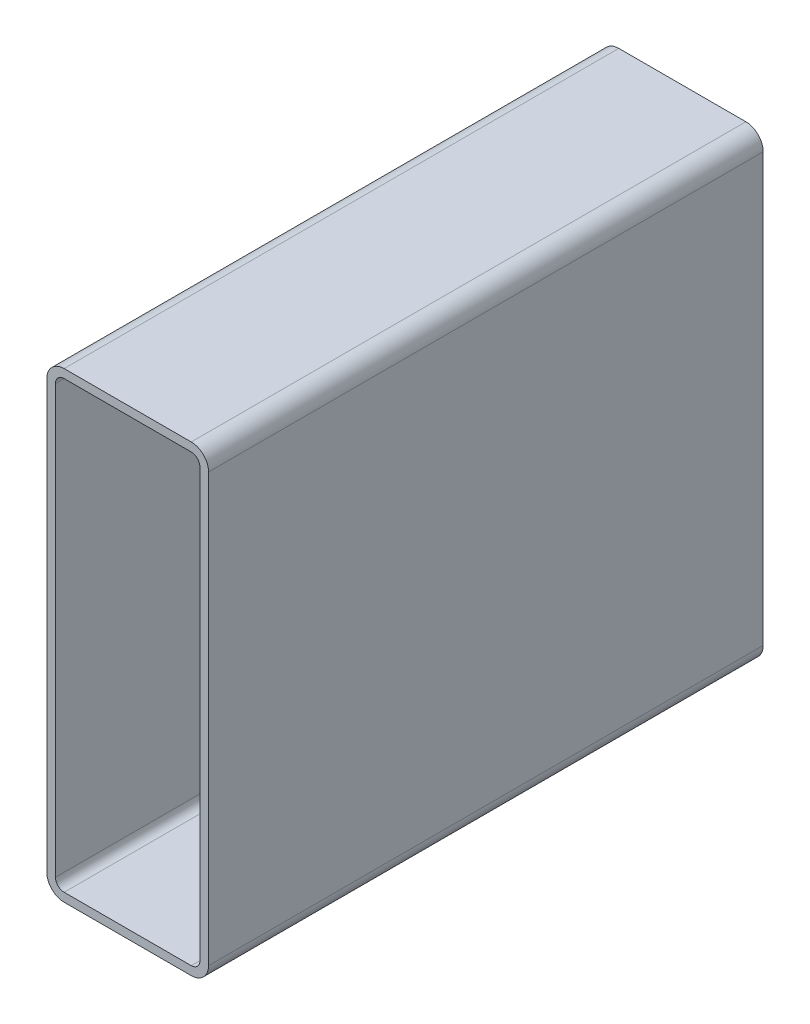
ISO-10303-21;
HEADER;
FILE_DESCRIPTION(('STEP AP214'),'2;1');
FILE_NAME('part.step','',(''),(''),'','','');
FILE_SCHEMA(('AUTOMOTIVE_DESIGN { 1 0 10303 214 1 1 1 1 }'));
ENDSEC;
DATA;
#1=APPLICATION_CONTEXT('core data for automotive mechanical design processes');
#2=APPLICATION_PROTOCOL_DEFINITION('international standard','automotive_design',2000,#1);
#3=PRODUCT_CONTEXT('',#1,'mechanical');
#4=PRODUCT('Part','Part','',(#3));
#5=PRODUCT_RELATED_PRODUCT_CATEGORY('part','',(#4));
#6=PRODUCT_DEFINITION_FORMATION('','',#4);
#7=PRODUCT_DEFINITION_CONTEXT('part definition',#1,'design');
#8=PRODUCT_DEFINITION('design','',#6,#7);
#9=PRODUCT_DEFINITION_SHAPE('','',#8);
#10=(LENGTH_UNIT() NAMED_UNIT(*) SI_UNIT(.MILLI.,.METRE.));
#11=(NAMED_UNIT(*) PLANE_ANGLE_UNIT() SI_UNIT($,.RADIAN.));
#12=(NAMED_UNIT(*) SI_UNIT($,.STERADIAN.) SOLID_ANGLE_UNIT());
#13=UNCERTAINTY_MEASURE_WITH_UNIT(LENGTH_MEASURE(1.E-05),#10,'distance_accuracy_value','');
#14=(GEOMETRIC_REPRESENTATION_CONTEXT(3) GLOBAL_UNCERTAINTY_ASSIGNED_CONTEXT((#13)) GLOBAL_UNIT_ASSIGNED_CONTEXT((#10,
#11,#12)) REPRESENTATION_CONTEXT('',''));
#15=CARTESIAN_POINT('',(0.,0.,0.));
#16=DIRECTION('',(0.,0.,1.));
#17=DIRECTION('',(1.,0.,0.));
#18=AXIS2_PLACEMENT_3D('',#15,#16,#17);
#19=CARTESIAN_POINT('',(11.6071469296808,246.395313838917,304.8));
#20=DIRECTION('',(0.,0.,1.));
#21=DIRECTION('',(1.,0.,0.));
#22=AXIS2_PLACEMENT_3D('',#19,#20,#21);
#23=PLANE('',#22);
#24=CARTESIAN_POINT('',(11.6071469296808,246.395313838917,304.8));
#25=DIRECTION('',(0.,0.,1.));
#26=DIRECTION('',(1.,0.,0.));
#27=AXIS2_PLACEMENT_3D('',#24,#25,#26);
#28=CIRCLE('',#27,9.52500000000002);
#29=CARTESIAN_POINT('',(11.6071469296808,255.920313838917,304.8));
#30=VERTEX_POINT('',#29);
#31=CARTESIAN_POINT('',(2.08214692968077,246.395313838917,304.8));
#32=VERTEX_POINT('',#31);
#33=EDGE_CURVE('E211',#30,#32,#28,.T.);
#34=ORIENTED_EDGE('',*,*,#33,.T.);
#35=DIRECTION('',(0.,-1.,0.));
#36=VECTOR('',#35,1.);
#37=CARTESIAN_POINT('',(2.08214692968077,11.4453138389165,304.8));
#38=LINE('',#37,#36);
#39=CARTESIAN_POINT('',(2.08214692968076,11.4453138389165,304.8));
#40=VERTEX_POINT('',#39);
#41=EDGE_CURVE('E214',#32,#40,#38,.T.);
#42=ORIENTED_EDGE('',*,*,#41,.T.);
#43=CARTESIAN_POINT('',(11.6071469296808,11.4453138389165,304.8));
#44=DIRECTION('',(0.,0.,1.));
#45=DIRECTION('',(1.,0.,0.));
#46=AXIS2_PLACEMENT_3D('',#43,#44,#45);
#47=CIRCLE('',#46,9.525);
#48=CARTESIAN_POINT('',(11.6071469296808,1.92031383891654,304.8));
#49=VERTEX_POINT('',#48);
#50=EDGE_CURVE('E217',#40,#49,#47,.T.);
#51=ORIENTED_EDGE('',*,*,#50,.T.);
#52=DIRECTION('',(1.,0.,0.));
#53=VECTOR('',#52,1.);
#54=CARTESIAN_POINT('',(81.4571469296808,1.92031383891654,304.8));
#55=LINE('',#54,#53);
#56=CARTESIAN_POINT('',(81.4571469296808,1.92031383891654,304.8));
#57=VERTEX_POINT('',#56);
#58=EDGE_CURVE('E219',#49,#57,#55,.T.);
#59=ORIENTED_EDGE('',*,*,#58,.T.);
#60=CARTESIAN_POINT('',(81.4571469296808,11.4453138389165,304.8));
#61=DIRECTION('',(0.,0.,1.));
#62=DIRECTION('',(1.,0.,0.));
#63=AXIS2_PLACEMENT_3D('',#60,#61,#62);
#64=CIRCLE('',#63,9.52500000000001);
#65=CARTESIAN_POINT('',(90.9821469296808,11.4453138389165,304.8));
#66=VERTEX_POINT('',#65);
#67=EDGE_CURVE('E221',#57,#66,#64,.T.);
#68=ORIENTED_EDGE('',*,*,#67,.T.);
#69=DIRECTION('',(0.,1.,0.));
#70=VECTOR('',#69,1.);
#71=CARTESIAN_POINT('',(90.9821469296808,246.395313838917,304.8));
#72=LINE('',#71,#70);
#73=CARTESIAN_POINT('',(90.9821469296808,246.395313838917,304.8));
#74=VERTEX_POINT('',#73);
#75=EDGE_CURVE('E223',#66,#74,#72,.T.);
#76=ORIENTED_EDGE('',*,*,#75,.T.);
#77=CARTESIAN_POINT('',(81.4571469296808,246.395313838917,304.8));
#78=DIRECTION('',(0.,0.,1.));
#79=DIRECTION('',(1.,0.,0.));
#80=AXIS2_PLACEMENT_3D('',#77,#78,#79);
#81=CIRCLE('',#80,9.52500000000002);
#82=CARTESIAN_POINT('',(81.4571469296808,255.920313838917,304.8));
#83=VERTEX_POINT('',#82);
#84=EDGE_CURVE('E225',#74,#83,#81,.T.);
#85=ORIENTED_EDGE('',*,*,#84,.T.);
#86=DIRECTION('',(-1.,0.,0.));
#87=VECTOR('',#86,1.);
#88=CARTESIAN_POINT('',(11.6071469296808,255.920313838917,304.8));
#89=LINE('',#88,#87);
#90=EDGE_CURVE('E227',#83,#30,#89,.T.);
#91=ORIENTED_EDGE('',*,*,#90,.T.);
#92=EDGE_LOOP('',(#34,#42,#51,#59,#68,#76,#85,#91));
#93=FACE_BOUND('',#92,.T.);
#94=DIRECTION('',(0.,-1.,0.));
#95=VECTOR('',#94,1.);
#96=CARTESIAN_POINT('',(6.84464692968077,11.4453138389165,304.8));
#97=LINE('',#96,#95);
#98=CARTESIAN_POINT('',(6.84464692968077,246.395313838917,304.8));
#99=VERTEX_POINT('',#98);
#100=CARTESIAN_POINT('',(6.84464692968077,11.4453138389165,304.8));
#101=VERTEX_POINT('',#100);
#102=EDGE_CURVE('E154',#99,#101,#97,.T.);
#103=ORIENTED_EDGE('',*,*,#102,.F.);
#104=CARTESIAN_POINT('',(11.6071469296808,246.395313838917,304.8));
#105=DIRECTION('',(0.,0.,1.));
#106=DIRECTION('',(1.,0.,0.));
#107=AXIS2_PLACEMENT_3D('',#104,#105,#106);
#108=CIRCLE('',#107,4.76250000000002);
#109=CARTESIAN_POINT('',(11.6071469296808,251.157813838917,304.8));
#110=VERTEX_POINT('',#109);
#111=EDGE_CURVE('E146',#110,#99,#108,.T.);
#112=ORIENTED_EDGE('',*,*,#111,.F.);
#113=DIRECTION('',(-1.,0.,0.));
#114=VECTOR('',#113,1.);
#115=CARTESIAN_POINT('',(11.6071469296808,251.157813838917,304.8));
#116=LINE('',#115,#114);
#117=CARTESIAN_POINT('',(81.4571469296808,251.157813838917,304.8));
#118=VERTEX_POINT('',#117);
#119=EDGE_CURVE('E179',#118,#110,#116,.T.);
#120=ORIENTED_EDGE('',*,*,#119,.F.);
#121=CARTESIAN_POINT('',(81.4571469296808,246.395313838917,304.8));
#122=DIRECTION('',(0.,0.,1.));
#123=DIRECTION('',(1.,0.,0.));
#124=AXIS2_PLACEMENT_3D('',#121,#122,#123);
#125=CIRCLE('',#124,4.76250000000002);
#126=CARTESIAN_POINT('',(86.2196469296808,246.395313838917,304.8));
#127=VERTEX_POINT('',#126);
#128=EDGE_CURVE('E177',#127,#118,#125,.T.);
#129=ORIENTED_EDGE('',*,*,#128,.F.);
#130=DIRECTION('',(0.,1.,0.));
#131=VECTOR('',#130,1.);
#132=CARTESIAN_POINT('',(86.2196469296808,246.395313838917,304.8));
#133=LINE('',#132,#131);
#134=CARTESIAN_POINT('',(86.2196469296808,11.4453138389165,304.8));
#135=VERTEX_POINT('',#134);
#136=EDGE_CURVE('E175',#135,#127,#133,.T.);
#137=ORIENTED_EDGE('',*,*,#136,.F.);
#138=CARTESIAN_POINT('',(81.4571469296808,11.4453138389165,304.8));
#139=DIRECTION('',(0.,0.,1.));
#140=DIRECTION('',(1.,0.,0.));
#141=AXIS2_PLACEMENT_3D('',#138,#139,#140);
#142=CIRCLE('',#141,4.7625);
#143=CARTESIAN_POINT('',(81.4571469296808,6.68281383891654,304.8));
#144=VERTEX_POINT('',#143);
#145=EDGE_CURVE('E173',#144,#135,#142,.T.);
#146=ORIENTED_EDGE('',*,*,#145,.F.);
#147=DIRECTION('',(1.,0.,0.));
#148=VECTOR('',#147,1.);
#149=CARTESIAN_POINT('',(81.4571469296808,6.68281383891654,304.8));
#150=LINE('',#149,#148);
#151=CARTESIAN_POINT('',(11.6071469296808,6.68281383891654,304.8));
#152=VERTEX_POINT('',#151);
#153=EDGE_CURVE('E169',#152,#144,#150,.T.);
#154=ORIENTED_EDGE('',*,*,#153,.F.);
#155=CARTESIAN_POINT('',(11.6071469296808,11.4453138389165,304.8));
#156=DIRECTION('',(0.,0.,1.));
#157=DIRECTION('',(1.,0.,0.));
#158=AXIS2_PLACEMENT_3D('',#155,#156,#157);
#159=CIRCLE('',#158,4.7625);
#160=EDGE_CURVE('E167',#101,#152,#159,.T.);
#161=ORIENTED_EDGE('',*,*,#160,.F.);
#162=EDGE_LOOP('',(#103,#112,#120,#129,#137,#146,#154,#161));
#163=FACE_BOUND('',#162,.T.);
#164=ADVANCED_FACE('F33',(#93,#163),#23,.T.);
#165=CARTESIAN_POINT('',(11.6071469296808,246.395313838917,0.));
#166=DIRECTION('',(0.,0.,1.));
#167=DIRECTION('',(1.,0.,0.));
#168=AXIS2_PLACEMENT_3D('',#165,#166,#167);
#169=PLANE('',#168);
#170=CARTESIAN_POINT('',(11.6071469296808,246.395313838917,0.));
#171=DIRECTION('',(0.,0.,1.));
#172=DIRECTION('',(1.,0.,0.));
#173=AXIS2_PLACEMENT_3D('',#170,#171,#172);
#174=CIRCLE('',#173,9.52500000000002);
#175=CARTESIAN_POINT('',(11.6071469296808,255.920313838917,0.));
#176=VERTEX_POINT('',#175);
#177=CARTESIAN_POINT('',(2.08214692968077,246.395313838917,0.));
#178=VERTEX_POINT('',#177);
#179=EDGE_CURVE('E162',#176,#178,#174,.T.);
#180=ORIENTED_EDGE('',*,*,#179,.F.);
#181=DIRECTION('',(-1.,0.,0.));
#182=VECTOR('',#181,1.);
#183=CARTESIAN_POINT('',(11.6071469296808,255.920313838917,0.));
#184=LINE('',#183,#182);
#185=CARTESIAN_POINT('',(81.4571469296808,255.920313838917,0.));
#186=VERTEX_POINT('',#185);
#187=EDGE_CURVE('E215',#186,#176,#184,.T.);
#188=ORIENTED_EDGE('',*,*,#187,.F.);
#189=CARTESIAN_POINT('',(81.4571469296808,246.395313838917,0.));
#190=DIRECTION('',(0.,0.,1.));
#191=DIRECTION('',(1.,0.,0.));
#192=AXIS2_PLACEMENT_3D('',#189,#190,#191);
#193=CIRCLE('',#192,9.52500000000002);
#194=CARTESIAN_POINT('',(90.9821469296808,246.395313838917,0.));
#195=VERTEX_POINT('',#194);
#196=EDGE_CURVE('E242',#195,#186,#193,.T.);
#197=ORIENTED_EDGE('',*,*,#196,.F.);
#198=DIRECTION('',(0.,1.,0.));
#199=VECTOR('',#198,1.);
#200=CARTESIAN_POINT('',(90.9821469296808,246.395313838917,0.));
#201=LINE('',#200,#199);
#202=CARTESIAN_POINT('',(90.9821469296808,11.4453138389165,0.));
#203=VERTEX_POINT('',#202);
#204=EDGE_CURVE('E240',#203,#195,#201,.T.);
#205=ORIENTED_EDGE('',*,*,#204,.F.);
#206=CARTESIAN_POINT('',(81.4571469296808,11.4453138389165,0.));
#207=DIRECTION('',(0.,0.,1.));
#208=DIRECTION('',(1.,0.,0.));
#209=AXIS2_PLACEMENT_3D('',#206,#207,#208);
#210=CIRCLE('',#209,9.52500000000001);
#211=CARTESIAN_POINT('',(81.4571469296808,1.92031383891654,0.));
#212=VERTEX_POINT('',#211);
#213=EDGE_CURVE('E238',#212,#203,#210,.T.);
#214=ORIENTED_EDGE('',*,*,#213,.F.);
#215=DIRECTION('',(1.,0.,0.));
#216=VECTOR('',#215,1.);
#217=CARTESIAN_POINT('',(81.4571469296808,1.92031383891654,0.));
#218=LINE('',#217,#216);
#219=CARTESIAN_POINT('',(11.6071469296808,1.92031383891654,0.));
#220=VERTEX_POINT('',#219);
#221=EDGE_CURVE('E236',#220,#212,#218,.T.);
#222=ORIENTED_EDGE('',*,*,#221,.F.);
#223=CARTESIAN_POINT('',(11.6071469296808,11.4453138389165,0.));
#224=DIRECTION('',(0.,0.,1.));
#225=DIRECTION('',(1.,0.,0.));
#226=AXIS2_PLACEMENT_3D('',#223,#224,#225);
#227=CIRCLE('',#226,9.525);
#228=CARTESIAN_POINT('',(2.08214692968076,11.4453138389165,0.));
#229=VERTEX_POINT('',#228);
#230=EDGE_CURVE('E234',#229,#220,#227,.T.);
#231=ORIENTED_EDGE('',*,*,#230,.F.);
#232=DIRECTION('',(0.,-1.,0.));
#233=VECTOR('',#232,1.);
#234=CARTESIAN_POINT('',(2.08214692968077,11.4453138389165,0.));
#235=LINE('',#234,#233);
#236=EDGE_CURVE('E232',#178,#229,#235,.T.);
#237=ORIENTED_EDGE('',*,*,#236,.F.);
#238=EDGE_LOOP('',(#180,#188,#197,#205,#214,#222,#231,#237));
#239=FACE_BOUND('',#238,.T.);
#240=CARTESIAN_POINT('',(11.6071469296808,246.395313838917,0.));
#241=DIRECTION('',(0.,0.,1.));
#242=DIRECTION('',(1.,0.,0.));
#243=AXIS2_PLACEMENT_3D('',#240,#241,#242);
#244=CIRCLE('',#243,4.76250000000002);
#245=CARTESIAN_POINT('',(11.6071469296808,251.157813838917,0.));
#246=VERTEX_POINT('',#245);
#247=CARTESIAN_POINT('',(6.84464692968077,246.395313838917,0.));
#248=VERTEX_POINT('',#247);
#249=EDGE_CURVE('E56',#246,#248,#244,.T.);
#250=ORIENTED_EDGE('',*,*,#249,.T.);
#251=DIRECTION('',(0.,-1.,0.));
#252=VECTOR('',#251,1.);
#253=CARTESIAN_POINT('',(6.84464692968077,11.4453138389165,0.));
#254=LINE('',#253,#252);
#255=CARTESIAN_POINT('',(6.84464692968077,11.4453138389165,0.));
#256=VERTEX_POINT('',#255);
#257=EDGE_CURVE('E161',#248,#256,#254,.T.);
#258=ORIENTED_EDGE('',*,*,#257,.T.);
#259=CARTESIAN_POINT('',(11.6071469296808,11.4453138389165,0.));
#260=DIRECTION('',(0.,0.,1.));
#261=DIRECTION('',(1.,0.,0.));
#262=AXIS2_PLACEMENT_3D('',#259,#260,#261);
#263=CIRCLE('',#262,4.7625);
#264=CARTESIAN_POINT('',(11.6071469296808,6.68281383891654,0.));
#265=VERTEX_POINT('',#264);
#266=EDGE_CURVE('E183',#256,#265,#263,.T.);
#267=ORIENTED_EDGE('',*,*,#266,.T.);
#268=DIRECTION('',(1.,0.,0.));
#269=VECTOR('',#268,1.);
#270=CARTESIAN_POINT('',(81.4571469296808,6.68281383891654,0.));
#271=LINE('',#270,#269);
#272=CARTESIAN_POINT('',(81.4571469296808,6.68281383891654,0.));
#273=VERTEX_POINT('',#272);
#274=EDGE_CURVE('E186',#265,#273,#271,.T.);
#275=ORIENTED_EDGE('',*,*,#274,.T.);
#276=CARTESIAN_POINT('',(81.4571469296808,11.4453138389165,0.));
#277=DIRECTION('',(0.,0.,1.));
#278=DIRECTION('',(1.,0.,0.));
#279=AXIS2_PLACEMENT_3D('',#276,#277,#278);
#280=CIRCLE('',#279,4.7625);
#281=CARTESIAN_POINT('',(86.2196469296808,11.4453138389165,0.));
#282=VERTEX_POINT('',#281);
#283=EDGE_CURVE('E189',#273,#282,#280,.T.);
#284=ORIENTED_EDGE('',*,*,#283,.T.);
#285=DIRECTION('',(0.,1.,0.));
#286=VECTOR('',#285,1.);
#287=CARTESIAN_POINT('',(86.2196469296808,246.395313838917,0.));
#288=LINE('',#287,#286);
#289=CARTESIAN_POINT('',(86.2196469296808,246.395313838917,0.));
#290=VERTEX_POINT('',#289);
#291=EDGE_CURVE('E192',#282,#290,#288,.T.);
#292=ORIENTED_EDGE('',*,*,#291,.T.);
#293=CARTESIAN_POINT('',(81.4571469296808,246.395313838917,0.));
#294=DIRECTION('',(0.,0.,1.));
#295=DIRECTION('',(1.,0.,0.));
#296=AXIS2_PLACEMENT_3D('',#293,#294,#295);
#297=CIRCLE('',#296,4.76250000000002);
#298=CARTESIAN_POINT('',(81.4571469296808,251.157813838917,0.));
#299=VERTEX_POINT('',#298);
#300=EDGE_CURVE('E195',#290,#299,#297,.T.);
#301=ORIENTED_EDGE('',*,*,#300,.T.);
#302=DIRECTION('',(-1.,0.,0.));
#303=VECTOR('',#302,1.);
#304=CARTESIAN_POINT('',(11.6071469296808,251.157813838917,0.));
#305=LINE('',#304,#303);
#306=EDGE_CURVE('E155',#299,#246,#305,.T.);
#307=ORIENTED_EDGE('',*,*,#306,.T.);
#308=EDGE_LOOP('',(#250,#258,#267,#275,#284,#292,#301,#307));
#309=FACE_BOUND('',#308,.T.);
#310=ADVANCED_FACE('F272',(#239,#309),#169,.F.);
#311=CARTESIAN_POINT('',(11.6071469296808,246.395313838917,304.8));
#312=DIRECTION('',(0.,0.,-1.));
#313=DIRECTION('',(-1.,0.,0.));
#314=AXIS2_PLACEMENT_3D('',#311,#312,#313);
#315=CYLINDRICAL_SURFACE('',#314,9.52500000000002);
#316=ORIENTED_EDGE('',*,*,#179,.T.);
#317=DIRECTION('',(0.,0.,-1.));
#318=VECTOR('',#317,1.);
#319=CARTESIAN_POINT('',(2.08214692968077,246.395313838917,304.8));
#320=LINE('',#319,#318);
#321=EDGE_CURVE('E11',#32,#178,#320,.T.);
#322=ORIENTED_EDGE('',*,*,#321,.F.);
#323=ORIENTED_EDGE('',*,*,#33,.F.);
#324=DIRECTION('',(0.,0.,-1.));
#325=VECTOR('',#324,1.);
#326=CARTESIAN_POINT('',(11.6071469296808,255.920313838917,304.8));
#327=LINE('',#326,#325);
#328=EDGE_CURVE('E229',#30,#176,#327,.T.);
#329=ORIENTED_EDGE('',*,*,#328,.T.);
#330=EDGE_LOOP('',(#316,#322,#323,#329));
#331=FACE_BOUND('',#330,.T.);
#332=ADVANCED_FACE('F35',(#331),#315,.T.);
#333=CARTESIAN_POINT('',(2.08214692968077,11.4453138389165,304.8));
#334=DIRECTION('',(1.,0.,0.));
#335=DIRECTION('',(0.,0.,-1.));
#336=AXIS2_PLACEMENT_3D('',#333,#334,#335);
#337=PLANE('',#336);
#338=ORIENTED_EDGE('',*,*,#236,.T.);
#339=DIRECTION('',(0.,0.,-1.));
#340=VECTOR('',#339,1.);
#341=CARTESIAN_POINT('',(2.08214692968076,11.4453138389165,304.8));
#342=LINE('',#341,#340);
#343=EDGE_CURVE('E41',#40,#229,#342,.T.);
#344=ORIENTED_EDGE('',*,*,#343,.F.);
#345=ORIENTED_EDGE('',*,*,#41,.F.);
#346=ORIENTED_EDGE('',*,*,#321,.T.);
#347=EDGE_LOOP('',(#338,#344,#345,#346));
#348=FACE_BOUND('',#347,.T.);
#349=ADVANCED_FACE('F289',(#348),#337,.F.);
#350=CARTESIAN_POINT('',(11.6071469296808,11.4453138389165,304.8));
#351=DIRECTION('',(0.,0.,-1.));
#352=DIRECTION('',(-1.,0.,0.));
#353=AXIS2_PLACEMENT_3D('',#350,#351,#352);
#354=CYLINDRICAL_SURFACE('',#353,9.525);
#355=ORIENTED_EDGE('',*,*,#230,.T.);
#356=DIRECTION('',(0.,0.,-1.));
#357=VECTOR('',#356,1.);
#358=CARTESIAN_POINT('',(11.6071469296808,1.92031383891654,304.8));
#359=LINE('',#358,#357);
#360=EDGE_CURVE('E259',#49,#220,#359,.T.);
#361=ORIENTED_EDGE('',*,*,#360,.F.);
#362=ORIENTED_EDGE('',*,*,#50,.F.);
#363=ORIENTED_EDGE('',*,*,#343,.T.);
#364=EDGE_LOOP('',(#355,#361,#362,#363));
#365=FACE_BOUND('',#364,.T.);
#366=ADVANCED_FACE('F266',(#365),#354,.T.);
#367=CARTESIAN_POINT('',(81.4571469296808,1.92031383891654,304.8));
#368=DIRECTION('',(0.,1.,0.));
#369=DIRECTION('',(0.,0.,1.));
#370=AXIS2_PLACEMENT_3D('',#367,#368,#369);
#371=PLANE('',#370);
#372=ORIENTED_EDGE('',*,*,#221,.T.);
#373=DIRECTION('',(0.,0.,-1.));
#374=VECTOR('',#373,1.);
#375=CARTESIAN_POINT('',(81.4571469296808,1.92031383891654,304.8));
#376=LINE('',#375,#374);
#377=EDGE_CURVE('E256',#57,#212,#376,.T.);
#378=ORIENTED_EDGE('',*,*,#377,.F.);
#379=ORIENTED_EDGE('',*,*,#58,.F.);
#380=ORIENTED_EDGE('',*,*,#360,.T.);
#381=EDGE_LOOP('',(#372,#378,#379,#380));
#382=FACE_BOUND('',#381,.T.);
#383=ADVANCED_FACE('F278',(#382),#371,.F.);
#384=CARTESIAN_POINT('',(81.4571469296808,11.4453138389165,304.8));
#385=DIRECTION('',(0.,0.,-1.));
#386=DIRECTION('',(-1.,0.,0.));
#387=AXIS2_PLACEMENT_3D('',#384,#385,#386);
#388=CYLINDRICAL_SURFACE('',#387,9.52500000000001);
#389=ORIENTED_EDGE('',*,*,#213,.T.);
#390=DIRECTION('',(0.,0.,-1.));
#391=VECTOR('',#390,1.);
#392=CARTESIAN_POINT('',(90.9821469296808,11.4453138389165,304.8));
#393=LINE('',#392,#391);
#394=EDGE_CURVE('E253',#66,#203,#393,.T.);
#395=ORIENTED_EDGE('',*,*,#394,.F.);
#396=ORIENTED_EDGE('',*,*,#67,.F.);
#397=ORIENTED_EDGE('',*,*,#377,.T.);
#398=EDGE_LOOP('',(#389,#395,#396,#397));
#399=FACE_BOUND('',#398,.T.);
#400=ADVANCED_FACE('F282',(#399),#388,.T.);
#401=CARTESIAN_POINT('',(90.9821469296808,246.395313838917,304.8));
#402=DIRECTION('',(-1.,0.,0.));
#403=DIRECTION('',(0.,0.,1.));
#404=AXIS2_PLACEMENT_3D('',#401,#402,#403);
#405=PLANE('',#404);
#406=ORIENTED_EDGE('',*,*,#204,.T.);
#407=DIRECTION('',(0.,0.,-1.));
#408=VECTOR('',#407,1.);
#409=CARTESIAN_POINT('',(90.9821469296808,246.395313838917,304.8));
#410=LINE('',#409,#408);
#411=EDGE_CURVE('E250',#74,#195,#410,.T.);
#412=ORIENTED_EDGE('',*,*,#411,.F.);
#413=ORIENTED_EDGE('',*,*,#75,.F.);
#414=ORIENTED_EDGE('',*,*,#394,.T.);
#415=EDGE_LOOP('',(#406,#412,#413,#414));
#416=FACE_BOUND('',#415,.T.);
#417=ADVANCED_FACE('F302',(#416),#405,.F.);
#418=CARTESIAN_POINT('',(81.4571469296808,246.395313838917,304.8));
#419=DIRECTION('',(0.,0.,-1.));
#420=DIRECTION('',(-1.,0.,0.));
#421=AXIS2_PLACEMENT_3D('',#418,#419,#420);
#422=CYLINDRICAL_SURFACE('',#421,9.52500000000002);
#423=ORIENTED_EDGE('',*,*,#196,.T.);
#424=DIRECTION('',(0.,0.,-1.));
#425=VECTOR('',#424,1.);
#426=CARTESIAN_POINT('',(81.4571469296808,255.920313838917,304.8));
#427=LINE('',#426,#425);
#428=EDGE_CURVE('E247',#83,#186,#427,.T.);
#429=ORIENTED_EDGE('',*,*,#428,.F.);
#430=ORIENTED_EDGE('',*,*,#84,.F.);
#431=ORIENTED_EDGE('',*,*,#411,.T.);
#432=EDGE_LOOP('',(#423,#429,#430,#431));
#433=FACE_BOUND('',#432,.T.);
#434=ADVANCED_FACE('F300',(#433),#422,.T.);
#435=CARTESIAN_POINT('',(11.6071469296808,255.920313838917,304.8));
#436=DIRECTION('',(0.,-1.,0.));
#437=DIRECTION('',(0.,0.,-1.));
#438=AXIS2_PLACEMENT_3D('',#435,#436,#437);
#439=PLANE('',#438);
#440=ORIENTED_EDGE('',*,*,#187,.T.);
#441=ORIENTED_EDGE('',*,*,#328,.F.);
#442=ORIENTED_EDGE('',*,*,#90,.F.);
#443=ORIENTED_EDGE('',*,*,#428,.T.);
#444=EDGE_LOOP('',(#440,#441,#442,#443));
#445=FACE_BOUND('',#444,.T.);
#446=ADVANCED_FACE('F295',(#445),#439,.F.);
#447=CARTESIAN_POINT('',(11.6071469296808,246.395313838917,304.8));
#448=DIRECTION('',(0.,0.,-1.));
#449=DIRECTION('',(-1.,0.,0.));
#450=AXIS2_PLACEMENT_3D('',#447,#448,#449);
#451=CYLINDRICAL_SURFACE('',#450,4.76250000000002);
#452=ORIENTED_EDGE('',*,*,#249,.F.);
#453=DIRECTION('',(0.,0.,-1.));
#454=VECTOR('',#453,1.);
#455=CARTESIAN_POINT('',(11.6071469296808,251.157813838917,304.8));
#456=LINE('',#455,#454);
#457=EDGE_CURVE('E150',#110,#246,#456,.T.);
#458=ORIENTED_EDGE('',*,*,#457,.F.);
#459=ORIENTED_EDGE('',*,*,#111,.T.);
#460=DIRECTION('',(0.,0.,-1.));
#461=VECTOR('',#460,1.);
#462=CARTESIAN_POINT('',(6.84464692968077,246.395313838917,304.8));
#463=LINE('',#462,#461);
#464=EDGE_CURVE('E149',#99,#248,#463,.T.);
#465=ORIENTED_EDGE('',*,*,#464,.T.);
#466=EDGE_LOOP('',(#452,#458,#459,#465));
#467=FACE_BOUND('',#466,.T.);
#468=ADVANCED_FACE('F148',(#467),#451,.F.);
#469=CARTESIAN_POINT('',(6.84464692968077,11.4453138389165,304.8));
#470=DIRECTION('',(1.,0.,0.));
#471=DIRECTION('',(0.,0.,-1.));
#472=AXIS2_PLACEMENT_3D('',#469,#470,#471);
#473=PLANE('',#472);
#474=ORIENTED_EDGE('',*,*,#257,.F.);
#475=ORIENTED_EDGE('',*,*,#464,.F.);
#476=ORIENTED_EDGE('',*,*,#102,.T.);
#477=DIRECTION('',(0.,0.,-1.));
#478=VECTOR('',#477,1.);
#479=CARTESIAN_POINT('',(6.84464692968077,11.4453138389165,304.8));
#480=LINE('',#479,#478);
#481=EDGE_CURVE('E163',#101,#256,#480,.T.);
#482=ORIENTED_EDGE('',*,*,#481,.T.);
#483=EDGE_LOOP('',(#474,#475,#476,#482));
#484=FACE_BOUND('',#483,.T.);
#485=ADVANCED_FACE('F158',(#484),#473,.T.);
#486=CARTESIAN_POINT('',(11.6071469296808,11.4453138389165,304.8));
#487=DIRECTION('',(0.,0.,-1.));
#488=DIRECTION('',(-1.,0.,0.));
#489=AXIS2_PLACEMENT_3D('',#486,#487,#488);
#490=CYLINDRICAL_SURFACE('',#489,4.7625);
#491=ORIENTED_EDGE('',*,*,#266,.F.);
#492=ORIENTED_EDGE('',*,*,#481,.F.);
#493=ORIENTED_EDGE('',*,*,#160,.T.);
#494=DIRECTION('',(0.,0.,-1.));
#495=VECTOR('',#494,1.);
#496=CARTESIAN_POINT('',(11.6071469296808,6.68281383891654,304.8));
#497=LINE('',#496,#495);
#498=EDGE_CURVE('E208',#152,#265,#497,.T.);
#499=ORIENTED_EDGE('',*,*,#498,.T.);
#500=EDGE_LOOP('',(#491,#492,#493,#499));
#501=FACE_BOUND('',#500,.T.);
#502=ADVANCED_FACE('F327',(#501),#490,.F.);
#503=CARTESIAN_POINT('',(81.4571469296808,6.68281383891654,304.8));
#504=DIRECTION('',(0.,1.,0.));
#505=DIRECTION('',(0.,0.,1.));
#506=AXIS2_PLACEMENT_3D('',#503,#504,#505);
#507=PLANE('',#506);
#508=ORIENTED_EDGE('',*,*,#274,.F.);
#509=ORIENTED_EDGE('',*,*,#498,.F.);
#510=ORIENTED_EDGE('',*,*,#153,.T.);
#511=DIRECTION('',(0.,0.,-1.));
#512=VECTOR('',#511,1.);
#513=CARTESIAN_POINT('',(81.4571469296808,6.68281383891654,304.8));
#514=LINE('',#513,#512);
#515=EDGE_CURVE('E206',#144,#273,#514,.T.);
#516=ORIENTED_EDGE('',*,*,#515,.T.);
#517=EDGE_LOOP('',(#508,#509,#510,#516));
#518=FACE_BOUND('',#517,.T.);
#519=ADVANCED_FACE('F331',(#518),#507,.T.);
#520=CARTESIAN_POINT('',(81.4571469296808,11.4453138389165,304.8));
#521=DIRECTION('',(0.,0.,-1.));
#522=DIRECTION('',(-1.,0.,0.));
#523=AXIS2_PLACEMENT_3D('',#520,#521,#522);
#524=CYLINDRICAL_SURFACE('',#523,4.7625);
#525=ORIENTED_EDGE('',*,*,#283,.F.);
#526=ORIENTED_EDGE('',*,*,#515,.F.);
#527=ORIENTED_EDGE('',*,*,#145,.T.);
#528=DIRECTION('',(0.,0.,-1.));
#529=VECTOR('',#528,1.);
#530=CARTESIAN_POINT('',(86.2196469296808,11.4453138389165,304.8));
#531=LINE('',#530,#529);
#532=EDGE_CURVE('E204',#135,#282,#531,.T.);
#533=ORIENTED_EDGE('',*,*,#532,.T.);
#534=EDGE_LOOP('',(#525,#526,#527,#533));
#535=FACE_BOUND('',#534,.T.);
#536=ADVANCED_FACE('F337',(#535),#524,.F.);
#537=CARTESIAN_POINT('',(86.2196469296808,246.395313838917,304.8));
#538=DIRECTION('',(-1.,0.,0.));
#539=DIRECTION('',(0.,0.,1.));
#540=AXIS2_PLACEMENT_3D('',#537,#538,#539);
#541=PLANE('',#540);
#542=ORIENTED_EDGE('',*,*,#291,.F.);
#543=ORIENTED_EDGE('',*,*,#532,.F.);
#544=ORIENTED_EDGE('',*,*,#136,.T.);
#545=DIRECTION('',(0.,0.,-1.));
#546=VECTOR('',#545,1.);
#547=CARTESIAN_POINT('',(86.2196469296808,246.395313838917,304.8));
#548=LINE('',#547,#546);
#549=EDGE_CURVE('E202',#127,#290,#548,.T.);
#550=ORIENTED_EDGE('',*,*,#549,.T.);
#551=EDGE_LOOP('',(#542,#543,#544,#550));
#552=FACE_BOUND('',#551,.T.);
#553=ADVANCED_FACE('F341',(#552),#541,.T.);
#554=CARTESIAN_POINT('',(81.4571469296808,246.395313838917,304.8));
#555=DIRECTION('',(0.,0.,-1.));
#556=DIRECTION('',(-1.,0.,0.));
#557=AXIS2_PLACEMENT_3D('',#554,#555,#556);
#558=CYLINDRICAL_SURFACE('',#557,4.76250000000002);
#559=ORIENTED_EDGE('',*,*,#300,.F.);
#560=ORIENTED_EDGE('',*,*,#549,.F.);
#561=ORIENTED_EDGE('',*,*,#128,.T.);
#562=DIRECTION('',(0.,0.,-1.));
#563=VECTOR('',#562,1.);
#564=CARTESIAN_POINT('',(81.4571469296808,251.157813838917,304.8));
#565=LINE('',#564,#563);
#566=EDGE_CURVE('E48',#118,#299,#565,.T.);
#567=ORIENTED_EDGE('',*,*,#566,.T.);
#568=EDGE_LOOP('',(#559,#560,#561,#567));
#569=FACE_BOUND('',#568,.T.);
#570=ADVANCED_FACE('F345',(#569),#558,.F.);
#571=CARTESIAN_POINT('',(11.6071469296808,251.157813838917,304.8));
#572=DIRECTION('',(0.,-1.,0.));
#573=DIRECTION('',(0.,0.,-1.));
#574=AXIS2_PLACEMENT_3D('',#571,#572,#573);
#575=PLANE('',#574);
#576=ORIENTED_EDGE('',*,*,#306,.F.);
#577=ORIENTED_EDGE('',*,*,#566,.F.);
#578=ORIENTED_EDGE('',*,*,#119,.T.);
#579=ORIENTED_EDGE('',*,*,#457,.T.);
#580=EDGE_LOOP('',(#576,#577,#578,#579));
#581=FACE_BOUND('',#580,.T.);
#582=ADVANCED_FACE('F349',(#581),#575,.T.);
#583=CLOSED_SHELL('',(#164,#310,#332,#349,#366,#383,#400,#417,#434,#446,#468,#485,#502,#519,
#536,#553,#570,#582));
#584=MANIFOLD_SOLID_BREP('B2',#583);
#585=ADVANCED_BREP_SHAPE_REPRESENTATION('',(#18,#584),#14);
#586=SHAPE_DEFINITION_REPRESENTATION(#9,#585);
ENDSEC;
END-ISO-10303-21;
